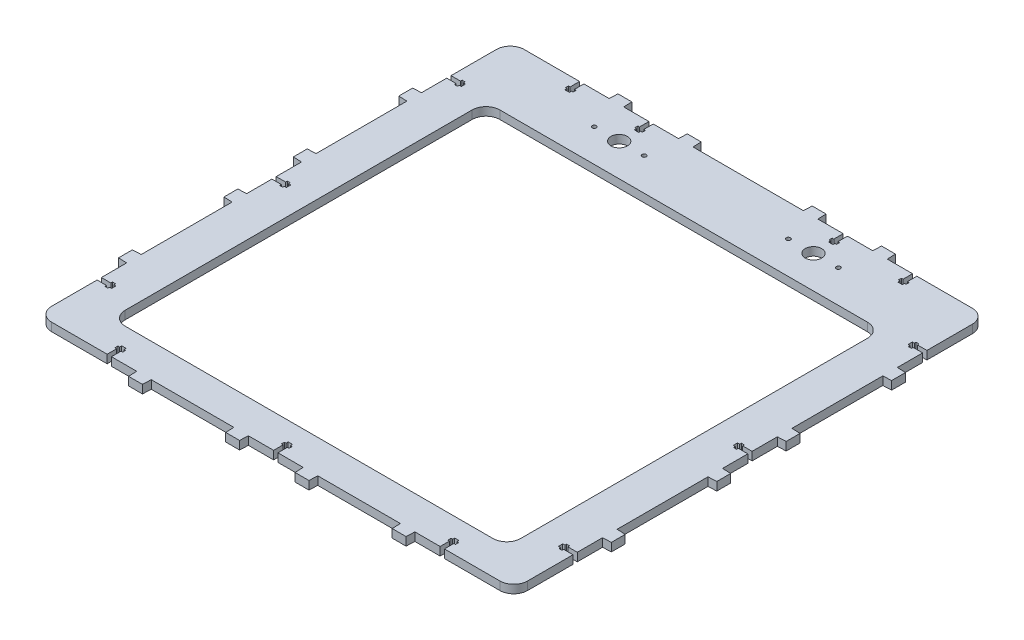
from build123d import *

# Parameters (mm, degrees)
SKETCH_1_R      = 5.95
SKETCH_1_R_2    = 1.5
EXTRUDE_1_DEPTH = 6


with BuildPart() as part:
    # Sketch 1 (on Top Plane) → Extrude 1 (new body)
    with BuildSketch(Plane(origin=(0, 0, 0), x_dir=(1, 0, 0), z_dir=(0, 1, 0))):
        with BuildLine():
            Line((177.6, 266.25), (171.5, 266))
            Line((171.5, 266), (171.5, 200.5))
            Line((171.5, 200.5), (177.6, 200.25))
            Line((177.6, 200.25), (177.6, 190.25))
            Line((177.6, 190.25), (171.5, 190))
            Line((171.5, 190), (171.5, 171.8))
            Line((171.5, 171.8), (164.7, 171.8))
            Line((164.7, 171.8), (164.7, 173))
            Line((164.7, 173), (162.5, 173))
            Line((162.5, 173), (162.5, 171.8))
            Line((162.5, 171.8), (161.000588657, 171.8))
            Line((161.000588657, 171.8), (161.000588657, 168.7))
            Line((161.000588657, 168.7), (162.5, 168.7))
            Line((162.5, 168.7), (162.5, 167.5))
            Line((162.5, 167.5), (164.7, 167.5))
            Line((164.7, 167.5), (164.7, 168.7))
            Line((164.7, 168.7), (171.5, 168.7))
            Line((171.5, 168.7), (171.5, 150.5))
            Line((171.5, 150.5), (177.6, 150.25))
            Line((177.6, 150.25), (177.6, 140.25))
            Line((177.6, 140.25), (171.5, 140))
            Line((171.5, 140), (171.5, 74.5))
            Line((171.5, 74.5), (177.6, 74.25))
            Line((177.6, 74.25), (177.6, 64.25))
            Line((177.6, 64.25), (171.5, 64))
            Line((171.5, 64), (171.5, 45.8))
            Line((171.5, 45.8), (164.700039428, 45.8))
            Line((164.700039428, 45.8), (164.700039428, 47))
            Line((164.700039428, 47), (162.5, 47))
            Line((162.5, 47), (162.5, 45.8))
            Line((162.5, 45.8), (161.000588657, 45.8))
            Line((161.000588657, 45.8), (161.000588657, 42.7))
            Line((161.000588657, 42.7), (162.5, 42.7))
            Line((162.5, 42.7), (162.5, 41.5))
            Line((162.5, 41.5), (164.700039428, 41.5))
            Line((164.700039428, 41.5), (164.700039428, 42.7))
            Line((164.700039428, 42.7), (171.5, 42.7))
            Line((171.5, 42.7), (171.5, 10))
            ThreePointArc((171.5, 10), (168.571067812, 2.928932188), (161.5, 0))
            Line((161.5, 0), (121.55, 0))
            Line((121.55, 0), (121.55, 6.799960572))
            Line((121.55, 6.799960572), (122.75, 6.799960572))
            Line((122.75, 6.799960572), (122.75, 9))
            Line((122.75, 9), (121.55, 9))
            Line((121.55, 9), (121.55, 10.5))
            Line((121.55, 10.5), (118.45, 10.5))
            Line((118.45, 10.5), (118.45, 9))
            Line((118.45, 9), (117.25, 9))
            Line((117.25, 9), (117.25, 6.799960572))
            Line((117.25, 6.799960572), (118.45, 6.799960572))
            Line((118.45, 6.799960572), (118.45, 0))
            Line((118.45, 0), (100.25, 0))
            Line((100.25, 0), (100, -6.1))
            Line((100, -6.1), (90, -6.1))
            Line((90, -6.1), (89.75, 0))
            Line((89.75, 0), (30.25, 0))
            Line((30.25, 0), (30, -6.1))
            Line((30, -6.1), (20, -6.1))
            Line((20, -6.1), (19.75, 0))
            Line((19.75, 0), (1.55, 0))
            Line((1.55, 0), (1.55, 6.799960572))
            Line((1.55, 6.799960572), (2.75, 6.799960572))
            Line((2.75, 6.799960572), (2.75, 9))
            Line((2.75, 9), (1.55, 9))
            Line((1.55, 9), (1.55, 10.5))
            Line((1.55, 10.5), (-1.55, 10.5))
            Line((-1.55, 10.5), (-1.55, 9))
            Line((-1.55, 9), (-2.75, 9))
            Line((-2.75, 9), (-2.75, 6.799960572))
            Line((-2.75, 6.799960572), (-1.55, 6.799960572))
            Line((-1.55, 6.799960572), (-1.55, 0))
            Line((-1.55, 0), (-19.75, 0))
            Line((-19.75, 0), (-20, -6.1))
            Line((-20, -6.1), (-30, -6.1))
            Line((-30, -6.1), (-30.25, 0))
            Line((-30.25, 0), (-89.75, 0))
            Line((-89.75, 0), (-90, -6.1))
            Line((-90, -6.1), (-100, -6.1))
            Line((-100, -6.1), (-100.25, 0))
            Line((-100.25, 0), (-118.45, 0))
            Line((-118.45, 0), (-118.45, 6.799960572))
            Line((-118.45, 6.799960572), (-117.25, 6.799960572))
            Line((-117.25, 6.799960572), (-117.25, 9))
            Line((-117.25, 9), (-118.45, 9))
            Line((-118.45, 9), (-118.45, 10.5))
            Line((-118.45, 10.5), (-121.55, 10.5))
            Line((-121.55, 10.5), (-121.55, 9))
            Line((-121.55, 9), (-122.75, 9))
            Line((-122.75, 9), (-122.75, 6.799960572))
            Line((-122.75, 6.799960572), (-121.55, 6.799960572))
            Line((-121.55, 6.799960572), (-121.55, 0))
            Line((-121.55, 0), (-161.5, 0))
            ThreePointArc((-161.5, 0), (-168.571067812, 2.928932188), (-171.5, 10))
            Line((-171.5, 10), (-171.5, 42.7))
            Line((-171.5, 42.7), (-164.700039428, 42.7))
            Line((-164.700039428, 42.7), (-164.700039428, 41.5))
            Line((-164.700039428, 41.5), (-162.5, 41.5))
            Line((-162.5, 41.5), (-162.5, 42.7))
            Line((-162.5, 42.7), (-161.000588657, 42.7))
            Line((-161.000588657, 42.7), (-161.000588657, 45.8))
            Line((-161.000588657, 45.8), (-162.5, 45.8))
            Line((-162.5, 45.8), (-162.5, 47))
            Line((-162.5, 47), (-164.700039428, 47))
            Line((-164.700039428, 47), (-164.700039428, 45.8))
            Line((-164.700039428, 45.8), (-171.5, 45.8))
            Line((-171.5, 45.8), (-171.5, 64))
            Line((-171.5, 64), (-177.6, 64.25))
            Line((-177.6, 64.25), (-177.6, 74.25))
            Line((-177.6, 74.25), (-171.5, 74.5))
            Line((-171.5, 74.5), (-171.5, 140))
            Line((-171.5, 140), (-177.6, 140.25))
            Line((-177.6, 140.25), (-177.6, 150.25))
            Line((-177.6, 150.25), (-171.5, 150.5))
            Line((-171.5, 150.5), (-171.5, 168.7))
            Line((-171.5, 168.7), (-164.7, 168.7))
            Line((-164.7, 168.7), (-164.7, 167.5))
            Line((-164.7, 167.5), (-162.5, 167.5))
            Line((-162.5, 167.5), (-162.5, 168.7))
            Line((-162.5, 168.7), (-161.000588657, 168.7))
            Line((-161.000588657, 168.7), (-161.000588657, 171.8))
            Line((-161.000588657, 171.8), (-162.5, 171.8))
            Line((-162.5, 171.8), (-162.5, 173))
            Line((-162.5, 173), (-164.7, 173))
            Line((-164.7, 173), (-164.7, 171.8))
            Line((-164.7, 171.8), (-171.5, 171.8))
            Line((-171.5, 171.8), (-171.5, 190))
            Line((-171.5, 190), (-177.6, 190.25))
            Line((-177.6, 190.25), (-177.6, 200.25))
            Line((-177.6, 200.25), (-171.5, 200.5))
            Line((-171.5, 200.5), (-171.5, 266))
            Line((-171.5, 266), (-177.6, 266.25))
            Line((-177.6, 266.25), (-177.6, 276.25))
            Line((-177.6, 276.25), (-171.5, 276.5))
            Line((-171.5, 276.5), (-171.5, 294.7))
            Line((-171.5, 294.7), (-164.700039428, 294.7))
            Line((-164.700039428, 294.7), (-164.700039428, 293.5))
            Line((-164.700039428, 293.5), (-162.5, 293.5))
            Line((-162.5, 293.5), (-162.5, 294.7))
            Line((-162.5, 294.7), (-161.000588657, 294.7))
            Line((-161.000588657, 294.7), (-161.000588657, 297.8))
            Line((-161.000588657, 297.8), (-162.5, 297.8))
            Line((-162.5, 297.8), (-162.5, 299))
            Line((-162.5, 299), (-164.700039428, 299))
            Line((-164.700039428, 299), (-164.700039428, 297.8))
            Line((-164.700039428, 297.8), (-171.5, 297.8))
            Line((-171.5, 297.8), (-171.5, 330.5))
            ThreePointArc((-171.5, 330.5), (-168.571067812, 337.571067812), (-161.5, 340.5))
            Line((-161.5, 340.5), (-121.55, 340.5))
            Line((-121.55, 340.5), (-121.55, 333.700039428))
            Line((-121.55, 333.700039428), (-122.75, 333.700039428))
            Line((-122.75, 333.700039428), (-122.75, 331.5))
            Line((-122.75, 331.5), (-121.55, 331.5))
            Line((-121.55, 331.5), (-121.55, 330))
            Line((-121.55, 330), (-118.45, 330))
            Line((-118.45, 330), (-118.45, 331.5))
            Line((-118.45, 331.5), (-117.25, 331.5))
            Line((-117.25, 331.5), (-117.25, 333.700039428))
            Line((-117.25, 333.700039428), (-118.45, 333.700039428))
            Line((-118.45, 333.700039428), (-118.45, 340.5))
            Line((-118.45, 340.5), (-100.25, 340.5))
            Line((-100.25, 340.5), (-100, 346.6))
            Line((-100, 346.6), (-90, 346.6))
            Line((-90, 346.6), (-89.75, 340.5))
            Line((-89.75, 340.5), (-71.55, 340.5))
            Line((-71.55, 340.5), (-71.55, 333.700039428))
            Line((-71.55, 333.700039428), (-72.75, 333.700039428))
            Line((-72.75, 333.700039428), (-72.75, 331.5))
            Line((-72.75, 331.5), (-71.55, 331.5))
            Line((-71.55, 331.5), (-71.55, 330))
            Line((-71.55, 330), (-68.45, 330))
            Line((-68.45, 330), (-68.45, 331.5))
            Line((-68.45, 331.5), (-67.25, 331.5))
            Line((-67.25, 331.5), (-67.25, 333.700039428))
            Line((-67.25, 333.700039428), (-68.45, 333.700039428))
            Line((-68.45, 333.700039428), (-68.45, 340.5))
            Line((-68.45, 340.5), (-50.25, 340.5))
            Line((-50.25, 340.5), (-50, 346.6))
            Line((-50, 346.6), (-40, 346.6))
            Line((-40, 346.6), (-39.75, 340.5))
            Line((-39.75, 340.5), (39.75, 340.5))
            Line((39.75, 340.5), (40, 346.6))
            Line((40, 346.6), (50, 346.6))
            Line((50, 346.6), (50.25, 340.5))
            Line((50.25, 340.5), (68.45, 340.5))
            Line((68.45, 340.5), (68.45, 333.700039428))
            Line((68.45, 333.700039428), (67.25, 333.700039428))
            Line((67.25, 333.700039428), (67.25, 331.5))
            Line((67.25, 331.5), (68.45, 331.5))
            Line((68.45, 331.5), (68.45, 330))
            Line((68.45, 330), (71.55, 330))
            Line((71.55, 330), (71.55, 331.5))
            Line((71.55, 331.5), (72.75, 331.5))
            Line((72.75, 331.5), (72.75, 333.700039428))
            Line((72.75, 333.700039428), (71.55, 333.700039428))
            Line((71.55, 333.700039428), (71.55, 340.5))
            Line((71.55, 340.5), (89.75, 340.5))
            Line((89.75, 340.5), (90, 346.6))
            Line((90, 346.6), (100, 346.6))
            Line((100, 346.6), (100.25, 340.5))
            Line((100.25, 340.5), (118.45, 340.5))
            Line((118.45, 340.5), (118.45, 333.700039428))
            Line((118.45, 333.700039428), (117.25, 333.700039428))
            Line((117.25, 333.700039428), (117.25, 331.5))
            Line((117.25, 331.5), (118.45, 331.5))
            Line((118.45, 331.5), (118.45, 330))
            Line((118.45, 330), (121.55, 330))
            Line((121.55, 330), (121.55, 331.5))
            Line((121.55, 331.5), (122.75, 331.5))
            Line((122.75, 331.5), (122.75, 333.700039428))
            Line((122.75, 333.700039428), (121.55, 333.700039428))
            Line((121.55, 333.700039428), (121.55, 340.5))
            Line((121.55, 340.5), (161.5, 340.5))
            ThreePointArc((161.5, 340.5), (168.571067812, 337.571067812), (171.5, 330.5))
            Line((171.5, 330.5), (171.5, 297.8))
            Line((171.5, 297.8), (164.700039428, 297.8))
            Line((164.700039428, 297.8), (164.700039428, 299))
            Line((164.700039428, 299), (162.5, 299))
            Line((162.5, 299), (162.5, 297.8))
            Line((162.5, 297.8), (161.000588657, 297.8))
            Line((161.000588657, 297.8), (161.000588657, 294.7))
            Line((161.000588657, 294.7), (162.5, 294.7))
            Line((162.5, 294.7), (162.5, 293.5))
            Line((162.5, 293.5), (164.700039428, 293.5))
            Line((164.700039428, 293.5), (164.700039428, 294.7))
            Line((164.700039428, 294.7), (171.5, 294.7))
            Line((171.5, 294.7), (171.5, 276.5))
            Line((171.5, 276.5), (177.6, 276.25))
            Line((177.6, 276.25), (177.6, 266.25))
        make_face()
        with Locations(Location((70, 317.5, 0), (0, 0, 90))):
            Circle(SKETCH_1_R, mode=Mode.SUBTRACT)
        with Locations(Location((52, 317.5, 0), (0, 0, 90))):
            Circle(SKETCH_1_R_2, mode=Mode.SUBTRACT)
        with Locations(Location((88, 317.5, 0), (0, 0, 90))):
            Circle(SKETCH_1_R_2, mode=Mode.SUBTRACT)
        with Locations(Location((-88, 317.5, 0), (0, 0, 270))):
            Circle(SKETCH_1_R_2, mode=Mode.SUBTRACT)
        with Locations(Location((-52, 317.5, 0), (0, 0, 270))):
            Circle(SKETCH_1_R_2, mode=Mode.SUBTRACT)
        with Locations(Location((-70, 317.5, 0), (0, 0, 270))):
            Circle(SKETCH_1_R, mode=Mode.SUBTRACT)
        with BuildLine():
            Line((-142.5, 284), (-142.5, 34))
            ThreePointArc((-142.5, 34), (-139.571067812, 26.928932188), (-132.5, 24))
            Line((-132.5, 24), (132.5, 24))
            ThreePointArc((132.5, 24), (139.571067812, 26.928932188), (142.5, 34))
            Line((142.5, 34), (142.5, 284))
            ThreePointArc((142.5, 284), (139.571067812, 291.071067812), (132.5, 294))
            Line((132.5, 294), (-132.5, 294))
            ThreePointArc((-132.5, 294), (-139.571067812, 291.071067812), (-142.5, 284))
        make_face(mode=Mode.SUBTRACT)
    extrude(amount=-EXTRUDE_1_DEPTH)


solid = part.part
